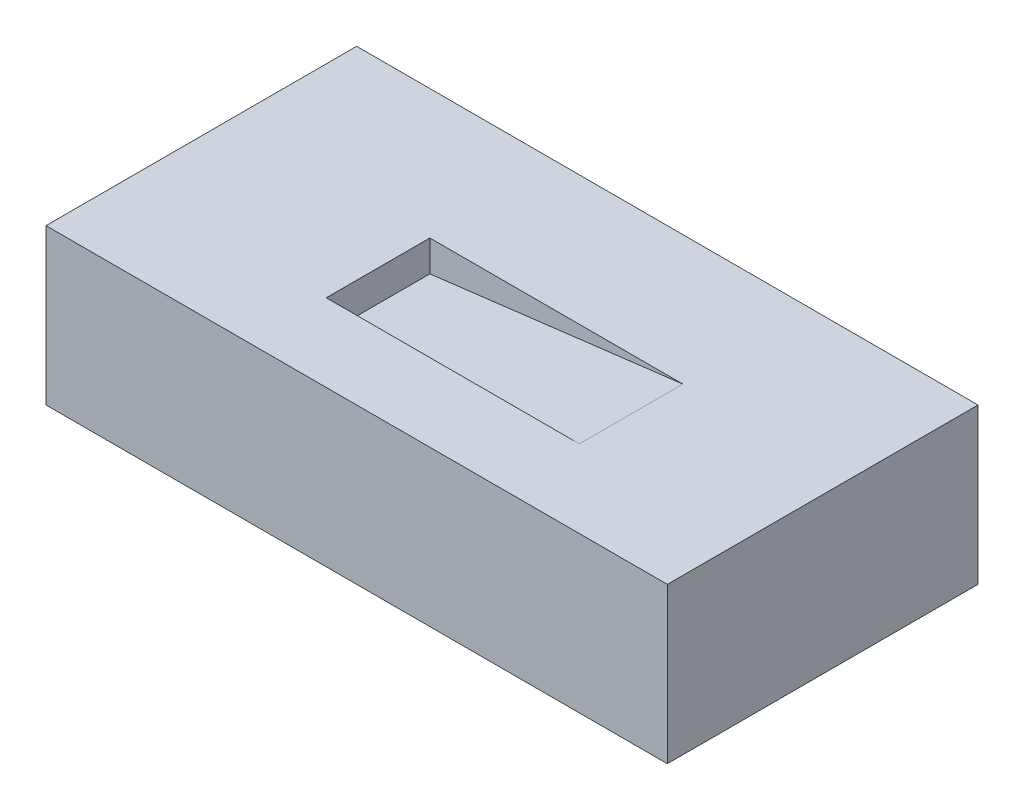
from build123d import *

# Parameters (mm, degrees)
SKIZZE1_W                       = 120
SKIZZE1_H                       = 30
LINEAR_AUSTRAGEN1_DEPTH         = 60
SCHNITT_LINEAR_START            = -15
SCHNITT_LINEAR_AUSTRAGEN1_DEPTH = 20


with BuildPart() as part:
    # Skizze1 → Linear austragen1 (new body)
    with BuildSketch(Plane.XY):
        with Locations((60, -15)):
            Rectangle(SKIZZE1_W, SKIZZE1_H)
    extrude(amount=-LINEAR_AUSTRAGEN1_DEPTH)

    # Skizze1_3 → Schnitt-Linear austragen1 (cut)
    with BuildSketch(Plane.XY.offset(SCHNITT_LINEAR_START)):
        Polygon((88, 0), (39.133921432, 0), (39.133921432, -6), align=None)
    extrude(amount=-SCHNITT_LINEAR_AUSTRAGEN1_DEPTH, mode=Mode.SUBTRACT)


solid = part.part
